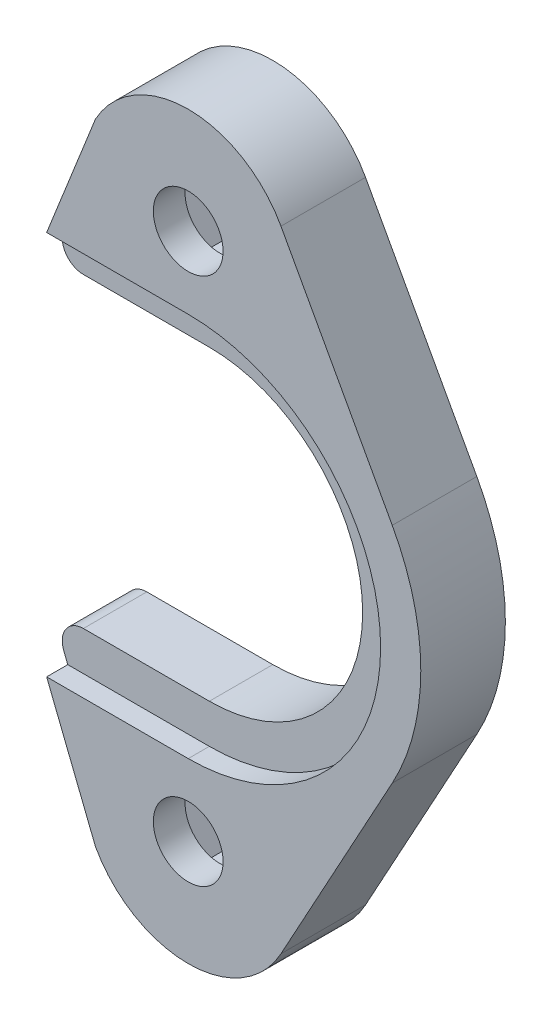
ISO-10303-21;
HEADER;
FILE_DESCRIPTION(('STEP AP214'),'2;1');
FILE_NAME('part.step','',(''),(''),'','','');
FILE_SCHEMA(('AUTOMOTIVE_DESIGN { 1 0 10303 214 1 1 1 1 }'));
ENDSEC;
DATA;
#1=APPLICATION_CONTEXT('core data for automotive mechanical design processes');
#2=APPLICATION_PROTOCOL_DEFINITION('international standard','automotive_design',2000,#1);
#3=PRODUCT_CONTEXT('',#1,'mechanical');
#4=PRODUCT('Part','Part','',(#3));
#5=PRODUCT_RELATED_PRODUCT_CATEGORY('part','',(#4));
#6=PRODUCT_DEFINITION_FORMATION('','',#4);
#7=PRODUCT_DEFINITION_CONTEXT('part definition',#1,'design');
#8=PRODUCT_DEFINITION('design','',#6,#7);
#9=PRODUCT_DEFINITION_SHAPE('','',#8);
#10=(LENGTH_UNIT() NAMED_UNIT(*) SI_UNIT(.MILLI.,.METRE.));
#11=(NAMED_UNIT(*) PLANE_ANGLE_UNIT() SI_UNIT($,.RADIAN.));
#12=(NAMED_UNIT(*) SI_UNIT($,.STERADIAN.) SOLID_ANGLE_UNIT());
#13=UNCERTAINTY_MEASURE_WITH_UNIT(LENGTH_MEASURE(1.E-05),#10,'distance_accuracy_value','');
#14=(GEOMETRIC_REPRESENTATION_CONTEXT(3) GLOBAL_UNCERTAINTY_ASSIGNED_CONTEXT((#13)) GLOBAL_UNIT_ASSIGNED_CONTEXT((#10,
#11,#12)) REPRESENTATION_CONTEXT('',''));
#15=CARTESIAN_POINT('',(0.,0.,0.));
#16=DIRECTION('',(0.,0.,1.));
#17=DIRECTION('',(1.,0.,0.));
#18=AXIS2_PLACEMENT_3D('',#15,#16,#17);
#19=CARTESIAN_POINT('',(0.,-7.25,-4.));
#20=DIRECTION('',(0.,1.,0.));
#21=DIRECTION('',(-1.,0.,0.));
#22=AXIS2_PLACEMENT_3D('',#19,#20,#21);
#23=PLANE('',#22);
#24=DIRECTION('',(-1.,0.,0.));
#25=VECTOR('',#24,1.);
#26=CARTESIAN_POINT('',(0.,-7.25,-4.));
#27=LINE('',#26,#25);
#28=CARTESIAN_POINT('',(0.,-7.25,-4.));
#29=VERTEX_POINT('',#28);
#30=CARTESIAN_POINT('',(-5.95765916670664,-7.25,-4.));
#31=VERTEX_POINT('',#30);
#32=EDGE_CURVE('E392',#29,#31,#27,.T.);
#33=ORIENTED_EDGE('',*,*,#32,.T.);
#34=DIRECTION('',(0.,0.,1.));
#35=VECTOR('',#34,1.);
#36=CARTESIAN_POINT('',(-5.95765916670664,-7.25,-4.));
#37=LINE('',#36,#35);
#38=CARTESIAN_POINT('',(-5.95765916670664,-7.25,-1.));
#39=VERTEX_POINT('',#38);
#40=EDGE_CURVE('E41',#31,#39,#37,.T.);
#41=ORIENTED_EDGE('',*,*,#40,.T.);
#42=DIRECTION('',(1.,0.,0.));
#43=VECTOR('',#42,1.);
#44=CARTESIAN_POINT('',(0.,-7.25,-1.));
#45=LINE('',#44,#43);
#46=CARTESIAN_POINT('',(0.,-7.25,-1.));
#47=VERTEX_POINT('',#46);
#48=EDGE_CURVE('E259',#39,#47,#45,.T.);
#49=ORIENTED_EDGE('',*,*,#48,.T.);
#50=DIRECTION('',(0.,0.,1.));
#51=VECTOR('',#50,1.);
#52=CARTESIAN_POINT('',(0.,-7.25,-4.));
#53=LINE('',#52,#51);
#54=EDGE_CURVE('E419',#29,#47,#53,.T.);
#55=ORIENTED_EDGE('',*,*,#54,.F.);
#56=EDGE_LOOP('',(#33,#41,#49,#55));
#57=FACE_BOUND('',#56,.T.);
#58=ADVANCED_FACE('F33',(#57),#23,.T.);
#59=CARTESIAN_POINT('',(0.,0.,-4.));
#60=DIRECTION('',(0.,0.,1.));
#61=DIRECTION('',(1.,0.,0.));
#62=AXIS2_PLACEMENT_3D('',#59,#60,#61);
#63=CYLINDRICAL_SURFACE('',#62,7.25);
#64=ORIENTED_EDGE('',*,*,#54,.T.);
#65=CARTESIAN_POINT('',(0.,0.,-1.));
#66=DIRECTION('',(0.,0.,1.));
#67=DIRECTION('',(1.,0.,0.));
#68=AXIS2_PLACEMENT_3D('',#65,#66,#67);
#69=CIRCLE('',#68,7.25);
#70=CARTESIAN_POINT('',(0.,7.25,-1.));
#71=VERTEX_POINT('',#70);
#72=EDGE_CURVE('E256',#47,#71,#69,.T.);
#73=ORIENTED_EDGE('',*,*,#72,.T.);
#74=DIRECTION('',(0.,0.,1.));
#75=VECTOR('',#74,1.);
#76=CARTESIAN_POINT('',(0.,7.25,-4.));
#77=LINE('',#76,#75);
#78=CARTESIAN_POINT('',(0.,7.25,-4.));
#79=VERTEX_POINT('',#78);
#80=EDGE_CURVE('E422',#79,#71,#77,.T.);
#81=ORIENTED_EDGE('',*,*,#80,.F.);
#82=CARTESIAN_POINT('',(0.,0.,-4.));
#83=DIRECTION('',(0.,0.,-1.));
#84=DIRECTION('',(1.,0.,0.));
#85=AXIS2_PLACEMENT_3D('',#82,#83,#84);
#86=CIRCLE('',#85,7.25);
#87=EDGE_CURVE('E389',#79,#29,#86,.T.);
#88=ORIENTED_EDGE('',*,*,#87,.T.);
#89=EDGE_LOOP('',(#64,#73,#81,#88));
#90=FACE_BOUND('',#89,.T.);
#91=ADVANCED_FACE('F461',(#90),#63,.F.);
#92=CARTESIAN_POINT('',(0.,7.25,-4.));
#93=DIRECTION('',(0.,-1.,0.));
#94=DIRECTION('',(0.,0.,-1.));
#95=AXIS2_PLACEMENT_3D('',#92,#93,#94);
#96=PLANE('',#95);
#97=DIRECTION('',(-1.,0.,0.));
#98=VECTOR('',#97,1.);
#99=CARTESIAN_POINT('',(0.,7.25,-1.));
#100=LINE('',#99,#98);
#101=CARTESIAN_POINT('',(-5.95765916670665,7.25,-1.));
#102=VERTEX_POINT('',#101);
#103=EDGE_CURVE('E253',#71,#102,#100,.T.);
#104=ORIENTED_EDGE('',*,*,#103,.T.);
#105=DIRECTION('',(0.,0.,1.));
#106=VECTOR('',#105,1.);
#107=CARTESIAN_POINT('',(-5.95765916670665,7.25,-4.));
#108=LINE('',#107,#106);
#109=CARTESIAN_POINT('',(-5.95765916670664,7.25,-4.));
#110=VERTEX_POINT('',#109);
#111=EDGE_CURVE('E449',#102,#110,#108,.F.);
#112=ORIENTED_EDGE('',*,*,#111,.T.);
#113=DIRECTION('',(1.,0.,0.));
#114=VECTOR('',#113,1.);
#115=CARTESIAN_POINT('',(0.,7.25,-4.));
#116=LINE('',#115,#114);
#117=EDGE_CURVE('E387',#110,#79,#116,.T.);
#118=ORIENTED_EDGE('',*,*,#117,.T.);
#119=ORIENTED_EDGE('',*,*,#80,.T.);
#120=EDGE_LOOP('',(#104,#112,#118,#119));
#121=FACE_BOUND('',#120,.T.);
#122=ADVANCED_FACE('F474',(#121),#96,.T.);
#123=CARTESIAN_POINT('',(0.,12.5001927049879,-4.));
#124=DIRECTION('',(0.,0.,1.));
#125=DIRECTION('',(1.,0.,0.));
#126=AXIS2_PLACEMENT_3D('',#123,#124,#125);
#127=CYLINDRICAL_SURFACE('',#126,1.65);
#128=CARTESIAN_POINT('',(0.,12.5001927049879,0.));
#129=DIRECTION('',(0.,0.,1.));
#130=DIRECTION('',(-1.,0.,0.));
#131=AXIS2_PLACEMENT_3D('',#128,#129,#130);
#132=CIRCLE('',#131,1.65);
#133=CARTESIAN_POINT('',(-1.65,12.5001927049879,0.));
#134=VERTEX_POINT('',#133);
#135=EDGE_CURVE('E361',#134,#134,#132,.T.);
#136=ORIENTED_EDGE('',*,*,#135,.T.);
#137=EDGE_LOOP('',(#136));
#138=FACE_BOUND('',#137,.T.);
#139=CARTESIAN_POINT('',(0.,12.5001927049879,-1.5));
#140=DIRECTION('',(0.,0.,-1.));
#141=DIRECTION('',(-1.,0.,0.));
#142=AXIS2_PLACEMENT_3D('',#139,#140,#141);
#143=CIRCLE('',#142,1.65);
#144=CARTESIAN_POINT('',(-1.65,12.5001927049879,-1.5));
#145=VERTEX_POINT('',#144);
#146=EDGE_CURVE('E350',#145,#145,#143,.F.);
#147=ORIENTED_EDGE('',*,*,#146,.F.);
#148=EDGE_LOOP('',(#147));
#149=FACE_BOUND('',#148,.T.);
#150=ADVANCED_FACE('F476',(#138,#149),#127,.F.);
#151=CARTESIAN_POINT('',(0.,-12.5001927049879,-4.));
#152=DIRECTION('',(0.,0.,1.));
#153=DIRECTION('',(1.,0.,0.));
#154=AXIS2_PLACEMENT_3D('',#151,#152,#153);
#155=CYLINDRICAL_SURFACE('',#154,5.);
#156=CARTESIAN_POINT('',(0.,-12.5001927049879,0.));
#157=DIRECTION('',(0.,0.,1.));
#158=DIRECTION('',(-1.,0.,0.));
#159=AXIS2_PLACEMENT_3D('',#156,#157,#158);
#160=CIRCLE('',#159,5.);
#161=CARTESIAN_POINT('',(-4.38636268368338,-14.9001557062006,0.));
#162=VERTEX_POINT('',#161);
#163=CARTESIAN_POINT('',(4.38636268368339,-14.9001557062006,0.));
#164=VERTEX_POINT('',#163);
#165=EDGE_CURVE('E367',#162,#164,#160,.T.);
#166=ORIENTED_EDGE('',*,*,#165,.F.);
#167=DIRECTION('',(0.,0.,1.));
#168=VECTOR('',#167,1.);
#169=CARTESIAN_POINT('',(-4.38636268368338,-14.9001557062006,-4.));
#170=LINE('',#169,#168);
#171=CARTESIAN_POINT('',(-4.38636268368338,-14.9001557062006,-4.));
#172=VERTEX_POINT('',#171);
#173=EDGE_CURVE('E415',#172,#162,#170,.T.);
#174=ORIENTED_EDGE('',*,*,#173,.F.);
#175=CARTESIAN_POINT('',(0.,-12.5001927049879,-4.));
#176=DIRECTION('',(0.,0.,1.));
#177=DIRECTION('',(-1.,0.,0.));
#178=AXIS2_PLACEMENT_3D('',#175,#176,#177);
#179=CIRCLE('',#178,5.);
#180=CARTESIAN_POINT('',(4.38636268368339,-14.9001557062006,-4.));
#181=VERTEX_POINT('',#180);
#182=EDGE_CURVE('E368',#172,#181,#179,.T.);
#183=ORIENTED_EDGE('',*,*,#182,.T.);
#184=DIRECTION('',(0.,0.,1.));
#185=VECTOR('',#184,1.);
#186=CARTESIAN_POINT('',(4.38636268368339,-14.9001557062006,-4.));
#187=LINE('',#186,#185);
#188=EDGE_CURVE('E396',#181,#164,#187,.T.);
#189=ORIENTED_EDGE('',*,*,#188,.T.);
#190=EDGE_LOOP('',(#166,#174,#183,#189));
#191=FACE_BOUND('',#190,.T.);
#192=ADVANCED_FACE('F482',(#191),#155,.T.);
#193=CARTESIAN_POINT('',(-7.43213117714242,-7.25,-4.));
#194=DIRECTION('',(-0.929074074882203,-0.369893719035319,0.));
#195=DIRECTION('',(0.369893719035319,-0.929074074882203,0.));
#196=AXIS2_PLACEMENT_3D('',#193,#194,#195);
#197=PLANE('',#196);
#198=DIRECTION('',(-0.369893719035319,0.929074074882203,0.));
#199=VECTOR('',#198,1.);
#200=CARTESIAN_POINT('',(-7.43213117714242,-7.25,-1.));
#201=LINE('',#200,#199);
#202=CARTESIAN_POINT('',(-6.69558777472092,-9.1,-1.));
#203=VERTEX_POINT('',#202);
#204=CARTESIAN_POINT('',(-6.88673324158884,-8.61989371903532,-1.));
#205=VERTEX_POINT('',#204);
#206=EDGE_CURVE('E261',#203,#205,#201,.T.);
#207=ORIENTED_EDGE('',*,*,#206,.T.);
#208=DIRECTION('',(0.,0.,1.));
#209=VECTOR('',#208,1.);
#210=CARTESIAN_POINT('',(-6.88673324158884,-8.61989371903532,-4.));
#211=LINE('',#210,#209);
#212=CARTESIAN_POINT('',(-6.88673324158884,-8.61989371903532,-4.));
#213=VERTEX_POINT('',#212);
#214=EDGE_CURVE('E11',#205,#213,#211,.F.);
#215=ORIENTED_EDGE('',*,*,#214,.T.);
#216=DIRECTION('',(0.369893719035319,-0.929074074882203,0.));
#217=VECTOR('',#216,1.);
#218=CARTESIAN_POINT('',(-7.43213117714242,-7.25,-4.));
#219=LINE('',#218,#217);
#220=EDGE_CURVE('E394',#213,#172,#219,.T.);
#221=ORIENTED_EDGE('',*,*,#220,.T.);
#222=ORIENTED_EDGE('',*,*,#173,.T.);
#223=DIRECTION('',(0.369893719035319,-0.929074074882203,0.));
#224=VECTOR('',#223,1.);
#225=CARTESIAN_POINT('',(-7.43213117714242,-7.25,0.));
#226=LINE('',#225,#224);
#227=CARTESIAN_POINT('',(-6.69558777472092,-9.1,0.));
#228=VERTEX_POINT('',#227);
#229=EDGE_CURVE('E372',#228,#162,#226,.T.);
#230=ORIENTED_EDGE('',*,*,#229,.F.);
#231=DIRECTION('',(0.,0.,1.));
#232=VECTOR('',#231,1.);
#233=CARTESIAN_POINT('',(-6.69558777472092,-9.1,-4.));
#234=LINE('',#233,#232);
#235=EDGE_CURVE('E251',#203,#228,#234,.T.);
#236=ORIENTED_EDGE('',*,*,#235,.F.);
#237=EDGE_LOOP('',(#207,#215,#221,#222,#230,#236));
#238=FACE_BOUND('',#237,.T.);
#239=ADVANCED_FACE('F492',(#238),#197,.T.);
#240=CARTESIAN_POINT('',(-7.43213117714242,7.25,-4.));
#241=DIRECTION('',(-0.929074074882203,0.369893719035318,0.));
#242=DIRECTION('',(-0.369893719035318,-0.929074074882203,0.));
#243=AXIS2_PLACEMENT_3D('',#240,#241,#242);
#244=PLANE('',#243);
#245=DIRECTION('',(-0.369893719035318,-0.929074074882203,0.));
#246=VECTOR('',#245,1.);
#247=CARTESIAN_POINT('',(-7.43213117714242,7.25,-4.));
#248=LINE('',#247,#246);
#249=CARTESIAN_POINT('',(-4.38636268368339,14.9001557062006,-4.));
#250=VERTEX_POINT('',#249);
#251=CARTESIAN_POINT('',(-6.88673324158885,8.61989371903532,-4.));
#252=VERTEX_POINT('',#251);
#253=EDGE_CURVE('E384',#250,#252,#248,.T.);
#254=ORIENTED_EDGE('',*,*,#253,.T.);
#255=DIRECTION('',(0.,0.,1.));
#256=VECTOR('',#255,1.);
#257=CARTESIAN_POINT('',(-6.88673324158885,8.61989371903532,-4.));
#258=LINE('',#257,#256);
#259=CARTESIAN_POINT('',(-6.88673324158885,8.61989371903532,-1.));
#260=VERTEX_POINT('',#259);
#261=EDGE_CURVE('E442',#252,#260,#258,.T.);
#262=ORIENTED_EDGE('',*,*,#261,.T.);
#263=DIRECTION('',(0.369893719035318,0.929074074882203,0.));
#264=VECTOR('',#263,1.);
#265=CARTESIAN_POINT('',(-7.43213117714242,7.25,-1.));
#266=LINE('',#265,#264);
#267=CARTESIAN_POINT('',(-6.69558777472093,9.1,-1.));
#268=VERTEX_POINT('',#267);
#269=EDGE_CURVE('E440',#260,#268,#266,.T.);
#270=ORIENTED_EDGE('',*,*,#269,.T.);
#271=DIRECTION('',(0.,0.,-1.));
#272=VECTOR('',#271,1.);
#273=CARTESIAN_POINT('',(-6.69558777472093,9.1,-4.));
#274=LINE('',#273,#272);
#275=CARTESIAN_POINT('',(-6.69558777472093,9.1,0.));
#276=VERTEX_POINT('',#275);
#277=EDGE_CURVE('E236',#276,#268,#274,.T.);
#278=ORIENTED_EDGE('',*,*,#277,.F.);
#279=DIRECTION('',(-0.369893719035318,-0.929074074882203,0.));
#280=VECTOR('',#279,1.);
#281=CARTESIAN_POINT('',(-7.43213117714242,7.25,0.));
#282=LINE('',#281,#280);
#283=CARTESIAN_POINT('',(-4.38636268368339,14.9001557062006,0.));
#284=VERTEX_POINT('',#283);
#285=EDGE_CURVE('E411',#284,#276,#282,.T.);
#286=ORIENTED_EDGE('',*,*,#285,.F.);
#287=DIRECTION('',(0.,0.,1.));
#288=VECTOR('',#287,1.);
#289=CARTESIAN_POINT('',(-4.38636268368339,14.9001557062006,-4.));
#290=LINE('',#289,#288);
#291=EDGE_CURVE('E425',#250,#284,#290,.T.);
#292=ORIENTED_EDGE('',*,*,#291,.F.);
#293=EDGE_LOOP('',(#254,#262,#270,#278,#286,#292));
#294=FACE_BOUND('',#293,.T.);
#295=ADVANCED_FACE('F473',(#294),#244,.T.);
#296=CARTESIAN_POINT('',(0.,12.5001927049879,-4.));
#297=DIRECTION('',(0.,0.,1.));
#298=DIRECTION('',(1.,0.,0.));
#299=AXIS2_PLACEMENT_3D('',#296,#297,#298);
#300=CYLINDRICAL_SURFACE('',#299,5.);
#301=CARTESIAN_POINT('',(0.,12.5001927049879,0.));
#302=DIRECTION('',(0.,0.,1.));
#303=DIRECTION('',(1.,0.,0.));
#304=AXIS2_PLACEMENT_3D('',#301,#302,#303);
#305=CIRCLE('',#304,5.);
#306=CARTESIAN_POINT('',(4.38636268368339,14.9001557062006,0.));
#307=VERTEX_POINT('',#306);
#308=EDGE_CURVE('E408',#307,#284,#305,.T.);
#309=ORIENTED_EDGE('',*,*,#308,.F.);
#310=DIRECTION('',(0.,0.,1.));
#311=VECTOR('',#310,1.);
#312=CARTESIAN_POINT('',(4.38636268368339,14.9001557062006,-4.));
#313=LINE('',#312,#311);
#314=CARTESIAN_POINT('',(4.38636268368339,14.9001557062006,-4.));
#315=VERTEX_POINT('',#314);
#316=EDGE_CURVE('E427',#315,#307,#313,.T.);
#317=ORIENTED_EDGE('',*,*,#316,.F.);
#318=CARTESIAN_POINT('',(0.,12.5001927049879,-4.));
#319=DIRECTION('',(0.,0.,1.));
#320=DIRECTION('',(1.,0.,0.));
#321=AXIS2_PLACEMENT_3D('',#318,#319,#320);
#322=CIRCLE('',#321,5.);
#323=EDGE_CURVE('E381',#315,#250,#322,.T.);
#324=ORIENTED_EDGE('',*,*,#323,.T.);
#325=ORIENTED_EDGE('',*,*,#291,.T.);
#326=EDGE_LOOP('',(#309,#317,#324,#325));
#327=FACE_BOUND('',#326,.T.);
#328=ADVANCED_FACE('F592',(#327),#300,.T.);
#329=CARTESIAN_POINT('',(9.64999790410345,5.27991860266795,-4.));
#330=DIRECTION('',(0.877272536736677,0.479992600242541,0.));
#331=DIRECTION('',(-0.479992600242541,0.877272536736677,0.));
#332=AXIS2_PLACEMENT_3D('',#329,#330,#331);
#333=PLANE('',#332);
#334=DIRECTION('',(-0.479992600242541,0.877272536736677,0.));
#335=VECTOR('',#334,1.);
#336=CARTESIAN_POINT('',(9.64999790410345,5.27991860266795,0.));
#337=LINE('',#336,#335);
#338=CARTESIAN_POINT('',(9.64999790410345,5.27991860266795,0.));
#339=VERTEX_POINT('',#338);
#340=EDGE_CURVE('E405',#339,#307,#337,.T.);
#341=ORIENTED_EDGE('',*,*,#340,.F.);
#342=DIRECTION('',(0.,0.,1.));
#343=VECTOR('',#342,1.);
#344=CARTESIAN_POINT('',(9.64999790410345,5.27991860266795,-4.));
#345=LINE('',#344,#343);
#346=CARTESIAN_POINT('',(9.64999790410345,5.27991860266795,-4.));
#347=VERTEX_POINT('',#346);
#348=EDGE_CURVE('E429',#347,#339,#345,.T.);
#349=ORIENTED_EDGE('',*,*,#348,.F.);
#350=DIRECTION('',(-0.479992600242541,0.877272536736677,0.));
#351=VECTOR('',#350,1.);
#352=CARTESIAN_POINT('',(9.64999790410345,5.27991860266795,-4.));
#353=LINE('',#352,#351);
#354=EDGE_CURVE('E378',#347,#315,#353,.T.);
#355=ORIENTED_EDGE('',*,*,#354,.T.);
#356=ORIENTED_EDGE('',*,*,#316,.T.);
#357=EDGE_LOOP('',(#341,#349,#355,#356));
#358=FACE_BOUND('',#357,.T.);
#359=ADVANCED_FACE('F588',(#358),#333,.T.);
#360=CARTESIAN_POINT('',(0.,0.,-4.));
#361=DIRECTION('',(0.,0.,1.));
#362=DIRECTION('',(1.,0.,0.));
#363=AXIS2_PLACEMENT_3D('',#360,#361,#362);
#364=CYLINDRICAL_SURFACE('',#363,11.);
#365=CARTESIAN_POINT('',(0.,0.,0.));
#366=DIRECTION('',(0.,0.,1.));
#367=DIRECTION('',(1.,0.,0.));
#368=AXIS2_PLACEMENT_3D('',#365,#366,#367);
#369=CIRCLE('',#368,11.);
#370=CARTESIAN_POINT('',(9.64999790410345,-5.27991860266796,0.));
#371=VERTEX_POINT('',#370);
#372=EDGE_CURVE('E402',#371,#339,#369,.T.);
#373=ORIENTED_EDGE('',*,*,#372,.F.);
#374=DIRECTION('',(0.,0.,1.));
#375=VECTOR('',#374,1.);
#376=CARTESIAN_POINT('',(9.64999790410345,-5.27991860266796,-4.));
#377=LINE('',#376,#375);
#378=CARTESIAN_POINT('',(9.64999790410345,-5.27991860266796,-4.));
#379=VERTEX_POINT('',#378);
#380=EDGE_CURVE('E431',#379,#371,#377,.T.);
#381=ORIENTED_EDGE('',*,*,#380,.F.);
#382=CARTESIAN_POINT('',(0.,0.,-4.));
#383=DIRECTION('',(0.,0.,1.));
#384=DIRECTION('',(1.,0.,0.));
#385=AXIS2_PLACEMENT_3D('',#382,#383,#384);
#386=CIRCLE('',#385,11.);
#387=EDGE_CURVE('E375',#379,#347,#386,.T.);
#388=ORIENTED_EDGE('',*,*,#387,.T.);
#389=ORIENTED_EDGE('',*,*,#348,.T.);
#390=EDGE_LOOP('',(#373,#381,#388,#389));
#391=FACE_BOUND('',#390,.T.);
#392=ADVANCED_FACE('F584',(#391),#364,.T.);
#393=CARTESIAN_POINT('',(9.64999790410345,-5.27991860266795,-4.));
#394=DIRECTION('',(0.877272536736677,-0.479992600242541,0.));
#395=DIRECTION('',(0.479992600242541,0.877272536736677,0.));
#396=AXIS2_PLACEMENT_3D('',#393,#394,#395);
#397=PLANE('',#396);
#398=DIRECTION('',(0.479992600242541,0.877272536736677,0.));
#399=VECTOR('',#398,1.);
#400=CARTESIAN_POINT('',(9.64999790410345,-5.27991860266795,0.));
#401=LINE('',#400,#399);
#402=EDGE_CURVE('E399',#164,#371,#401,.T.);
#403=ORIENTED_EDGE('',*,*,#402,.F.);
#404=ORIENTED_EDGE('',*,*,#188,.F.);
#405=DIRECTION('',(0.479992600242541,0.877272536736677,0.));
#406=VECTOR('',#405,1.);
#407=CARTESIAN_POINT('',(9.64999790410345,-5.27991860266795,-4.));
#408=LINE('',#407,#406);
#409=EDGE_CURVE('E371',#181,#379,#408,.T.);
#410=ORIENTED_EDGE('',*,*,#409,.T.);
#411=ORIENTED_EDGE('',*,*,#380,.T.);
#412=EDGE_LOOP('',(#403,#404,#410,#411));
#413=FACE_BOUND('',#412,.T.);
#414=ADVANCED_FACE('F502',(#413),#397,.T.);
#415=CARTESIAN_POINT('',(0.,-12.5001927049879,-4.));
#416=DIRECTION('',(0.,0.,-1.));
#417=DIRECTION('',(-1.,0.,0.));
#418=AXIS2_PLACEMENT_3D('',#415,#416,#417);
#419=PLANE('',#418);
#420=DIRECTION('',(1.,0.,0.));
#421=VECTOR('',#420,1.);
#422=CARTESIAN_POINT('',(1.64544826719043,-9.65019270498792,-4.));
#423=LINE('',#422,#421);
#424=CARTESIAN_POINT('',(-1.64544826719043,-9.65019270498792,-4.));
#425=VERTEX_POINT('',#424);
#426=CARTESIAN_POINT('',(1.64544826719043,-9.65019270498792,-4.));
#427=VERTEX_POINT('',#426);
#428=EDGE_CURVE('E263',#425,#427,#423,.T.);
#429=ORIENTED_EDGE('',*,*,#428,.F.);
#430=DIRECTION('',(0.5,0.866025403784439,0.));
#431=VECTOR('',#430,1.);
#432=CARTESIAN_POINT('',(-1.64544826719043,-9.65019270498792,-4.));
#433=LINE('',#432,#431);
#434=CARTESIAN_POINT('',(-3.29089653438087,-12.5001927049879,-4.));
#435=VERTEX_POINT('',#434);
#436=EDGE_CURVE('E268',#435,#425,#433,.T.);
#437=ORIENTED_EDGE('',*,*,#436,.F.);
#438=DIRECTION('',(-0.5,0.866025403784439,0.));
#439=VECTOR('',#438,1.);
#440=CARTESIAN_POINT('',(-3.29089653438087,-12.5001927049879,-4.));
#441=LINE('',#440,#439);
#442=CARTESIAN_POINT('',(-1.64544826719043,-15.3501927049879,-4.));
#443=VERTEX_POINT('',#442);
#444=EDGE_CURVE('E294',#443,#435,#441,.T.);
#445=ORIENTED_EDGE('',*,*,#444,.F.);
#446=DIRECTION('',(-1.,0.,0.));
#447=VECTOR('',#446,1.);
#448=CARTESIAN_POINT('',(-1.64544826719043,-15.3501927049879,-4.));
#449=LINE('',#448,#447);
#450=CARTESIAN_POINT('',(1.64544826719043,-15.3501927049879,-4.));
#451=VERTEX_POINT('',#450);
#452=EDGE_CURVE('E291',#451,#443,#449,.T.);
#453=ORIENTED_EDGE('',*,*,#452,.F.);
#454=DIRECTION('',(-0.5,-0.866025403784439,0.));
#455=VECTOR('',#454,1.);
#456=CARTESIAN_POINT('',(1.64544826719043,-15.3501927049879,-4.));
#457=LINE('',#456,#455);
#458=CARTESIAN_POINT('',(3.29089653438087,-12.5001927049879,-4.));
#459=VERTEX_POINT('',#458);
#460=EDGE_CURVE('E288',#459,#451,#457,.T.);
#461=ORIENTED_EDGE('',*,*,#460,.F.);
#462=DIRECTION('',(0.5,-0.866025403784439,0.));
#463=VECTOR('',#462,1.);
#464=CARTESIAN_POINT('',(3.29089653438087,-12.5001927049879,-4.));
#465=LINE('',#464,#463);
#466=EDGE_CURVE('E285',#427,#459,#465,.T.);
#467=ORIENTED_EDGE('',*,*,#466,.F.);
#468=EDGE_LOOP('',(#429,#437,#445,#453,#461,#467));
#469=FACE_BOUND('',#468,.T.);
#470=DIRECTION('',(-0.5,0.866025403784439,0.));
#471=VECTOR('',#470,1.);
#472=CARTESIAN_POINT('',(-1.64544826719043,9.65019270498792,-4.));
#473=LINE('',#472,#471);
#474=CARTESIAN_POINT('',(-1.64544826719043,9.65019270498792,-4.));
#475=VERTEX_POINT('',#474);
#476=CARTESIAN_POINT('',(-3.29089653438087,12.5001927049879,-4.));
#477=VERTEX_POINT('',#476);
#478=EDGE_CURVE('E332',#475,#477,#473,.T.);
#479=ORIENTED_EDGE('',*,*,#478,.F.);
#480=DIRECTION('',(-1.,0.,0.));
#481=VECTOR('',#480,1.);
#482=CARTESIAN_POINT('',(1.64544826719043,9.65019270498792,-4.));
#483=LINE('',#482,#481);
#484=CARTESIAN_POINT('',(1.64544826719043,9.65019270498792,-4.));
#485=VERTEX_POINT('',#484);
#486=EDGE_CURVE('E316',#485,#475,#483,.T.);
#487=ORIENTED_EDGE('',*,*,#486,.F.);
#488=DIRECTION('',(-0.5,-0.866025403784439,0.));
#489=VECTOR('',#488,1.);
#490=CARTESIAN_POINT('',(3.29089653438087,12.5001927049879,-4.));
#491=LINE('',#490,#489);
#492=CARTESIAN_POINT('',(3.29089653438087,12.5001927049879,-4.));
#493=VERTEX_POINT('',#492);
#494=EDGE_CURVE('E343',#493,#485,#491,.T.);
#495=ORIENTED_EDGE('',*,*,#494,.F.);
#496=DIRECTION('',(0.5,-0.866025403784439,0.));
#497=VECTOR('',#496,1.);
#498=CARTESIAN_POINT('',(1.64544826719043,15.3501927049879,-4.));
#499=LINE('',#498,#497);
#500=CARTESIAN_POINT('',(1.64544826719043,15.3501927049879,-4.));
#501=VERTEX_POINT('',#500);
#502=EDGE_CURVE('E340',#501,#493,#499,.T.);
#503=ORIENTED_EDGE('',*,*,#502,.F.);
#504=DIRECTION('',(1.,0.,0.));
#505=VECTOR('',#504,1.);
#506=CARTESIAN_POINT('',(-1.64544826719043,15.3501927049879,-4.));
#507=LINE('',#506,#505);
#508=CARTESIAN_POINT('',(-1.64544826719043,15.3501927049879,-4.));
#509=VERTEX_POINT('',#508);
#510=EDGE_CURVE('E337',#509,#501,#507,.T.);
#511=ORIENTED_EDGE('',*,*,#510,.F.);
#512=DIRECTION('',(0.5,0.866025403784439,0.));
#513=VECTOR('',#512,1.);
#514=CARTESIAN_POINT('',(-3.29089653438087,12.5001927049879,-4.));
#515=LINE('',#514,#513);
#516=EDGE_CURVE('E334',#477,#509,#515,.T.);
#517=ORIENTED_EDGE('',*,*,#516,.F.);
#518=EDGE_LOOP('',(#479,#487,#495,#503,#511,#517));
#519=FACE_BOUND('',#518,.T.);
#520=ORIENTED_EDGE('',*,*,#117,.F.);
#521=CARTESIAN_POINT('',(-5.95765916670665,8.25,-4.));
#522=DIRECTION('',(0.,0.,-1.));
#523=DIRECTION('',(-1.,0.,0.));
#524=AXIS2_PLACEMENT_3D('',#521,#522,#523);
#525=CIRCLE('',#524,1.);
#526=EDGE_CURVE('E452',#110,#252,#525,.T.);
#527=ORIENTED_EDGE('',*,*,#526,.T.);
#528=ORIENTED_EDGE('',*,*,#253,.F.);
#529=ORIENTED_EDGE('',*,*,#323,.F.);
#530=ORIENTED_EDGE('',*,*,#354,.F.);
#531=ORIENTED_EDGE('',*,*,#387,.F.);
#532=ORIENTED_EDGE('',*,*,#409,.F.);
#533=ORIENTED_EDGE('',*,*,#182,.F.);
#534=ORIENTED_EDGE('',*,*,#220,.F.);
#535=CARTESIAN_POINT('',(-5.95765916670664,-8.25,-4.));
#536=DIRECTION('',(0.,0.,-1.));
#537=DIRECTION('',(-1.,0.,0.));
#538=AXIS2_PLACEMENT_3D('',#535,#536,#537);
#539=CIRCLE('',#538,1.);
#540=EDGE_CURVE('E48',#213,#31,#539,.T.);
#541=ORIENTED_EDGE('',*,*,#540,.T.);
#542=ORIENTED_EDGE('',*,*,#32,.F.);
#543=ORIENTED_EDGE('',*,*,#87,.F.);
#544=EDGE_LOOP('',(#520,#527,#528,#529,#530,#531,#532,#533,#534,#541,#542,#543));
#545=FACE_BOUND('',#544,.T.);
#546=ADVANCED_FACE('F464',(#469,#519,#545),#419,.T.);
#547=CARTESIAN_POINT('',(0.,-12.5001927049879,0.));
#548=DIRECTION('',(0.,0.,-1.));
#549=DIRECTION('',(-1.,0.,0.));
#550=AXIS2_PLACEMENT_3D('',#547,#548,#549);
#551=PLANE('',#550);
#552=ORIENTED_EDGE('',*,*,#135,.F.);
#553=EDGE_LOOP('',(#552));
#554=FACE_BOUND('',#553,.T.);
#555=CARTESIAN_POINT('',(0.,-12.5001927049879,0.));
#556=DIRECTION('',(0.,0.,1.));
#557=DIRECTION('',(1.,0.,0.));
#558=AXIS2_PLACEMENT_3D('',#555,#556,#557);
#559=CIRCLE('',#558,1.65);
#560=CARTESIAN_POINT('',(1.65,-12.5001927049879,0.));
#561=VERTEX_POINT('',#560);
#562=EDGE_CURVE('E364',#561,#561,#559,.T.);
#563=ORIENTED_EDGE('',*,*,#562,.F.);
#564=EDGE_LOOP('',(#563));
#565=FACE_BOUND('',#564,.T.);
#566=CARTESIAN_POINT('',(0.,0.,0.));
#567=DIRECTION('',(0.,0.,1.));
#568=DIRECTION('',(1.,0.,0.));
#569=AXIS2_PLACEMENT_3D('',#566,#567,#568);
#570=CIRCLE('',#569,9.1);
#571=CARTESIAN_POINT('',(0.,-9.1,0.));
#572=VERTEX_POINT('',#571);
#573=CARTESIAN_POINT('',(0.,9.1,0.));
#574=VERTEX_POINT('',#573);
#575=EDGE_CURVE('E225',#572,#574,#570,.T.);
#576=ORIENTED_EDGE('',*,*,#575,.F.);
#577=DIRECTION('',(-1.,0.,0.));
#578=VECTOR('',#577,1.);
#579=CARTESIAN_POINT('',(0.,-9.1,0.));
#580=LINE('',#579,#578);
#581=EDGE_CURVE('E418',#572,#228,#580,.T.);
#582=ORIENTED_EDGE('',*,*,#581,.T.);
#583=ORIENTED_EDGE('',*,*,#229,.T.);
#584=ORIENTED_EDGE('',*,*,#165,.T.);
#585=ORIENTED_EDGE('',*,*,#402,.T.);
#586=ORIENTED_EDGE('',*,*,#372,.T.);
#587=ORIENTED_EDGE('',*,*,#340,.T.);
#588=ORIENTED_EDGE('',*,*,#308,.T.);
#589=ORIENTED_EDGE('',*,*,#285,.T.);
#590=DIRECTION('',(-1.,0.,0.));
#591=VECTOR('',#590,1.);
#592=CARTESIAN_POINT('',(0.,9.1,0.));
#593=LINE('',#592,#591);
#594=EDGE_CURVE('E243',#574,#276,#593,.T.);
#595=ORIENTED_EDGE('',*,*,#594,.F.);
#596=EDGE_LOOP('',(#576,#582,#583,#584,#585,#586,#587,#588,#589,#595));
#597=FACE_BOUND('',#596,.T.);
#598=ADVANCED_FACE('F495',(#554,#565,#597),#551,.F.);
#599=CARTESIAN_POINT('',(0.,-12.5001927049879,-4.));
#600=DIRECTION('',(0.,0.,1.));
#601=DIRECTION('',(1.,0.,0.));
#602=AXIS2_PLACEMENT_3D('',#599,#600,#601);
#603=CYLINDRICAL_SURFACE('',#602,1.65);
#604=CARTESIAN_POINT('',(0.,-12.5001927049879,-1.5));
#605=DIRECTION('',(0.,0.,1.));
#606=DIRECTION('',(1.,0.,0.));
#607=AXIS2_PLACEMENT_3D('',#604,#605,#606);
#608=CIRCLE('',#607,1.65);
#609=CARTESIAN_POINT('',(1.65,-12.5001927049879,-1.5));
#610=VERTEX_POINT('',#609);
#611=EDGE_CURVE('E301',#610,#610,#608,.F.);
#612=ORIENTED_EDGE('',*,*,#611,.T.);
#613=EDGE_LOOP('',(#612));
#614=FACE_BOUND('',#613,.T.);
#615=ORIENTED_EDGE('',*,*,#562,.T.);
#616=EDGE_LOOP('',(#615));
#617=FACE_BOUND('',#616,.T.);
#618=ADVANCED_FACE('F498',(#614,#617),#603,.F.);
#619=CARTESIAN_POINT('',(0.,0.,-1.5));
#620=DIRECTION('',(0.,0.,-1.));
#621=DIRECTION('',(-1.,0.,0.));
#622=AXIS2_PLACEMENT_3D('',#619,#620,#621);
#623=PLANE('',#622);
#624=DIRECTION('',(-0.5,0.866025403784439,0.));
#625=VECTOR('',#624,1.);
#626=CARTESIAN_POINT('',(-1.64544826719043,9.65019270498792,-1.5));
#627=LINE('',#626,#625);
#628=CARTESIAN_POINT('',(-1.64544826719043,9.65019270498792,-1.5));
#629=VERTEX_POINT('',#628);
#630=CARTESIAN_POINT('',(-3.29089653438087,12.5001927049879,-1.5));
#631=VERTEX_POINT('',#630);
#632=EDGE_CURVE('E312',#629,#631,#627,.T.);
#633=ORIENTED_EDGE('',*,*,#632,.T.);
#634=DIRECTION('',(0.5,0.866025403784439,0.));
#635=VECTOR('',#634,1.);
#636=CARTESIAN_POINT('',(-3.29089653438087,12.5001927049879,-1.5));
#637=LINE('',#636,#635);
#638=CARTESIAN_POINT('',(-1.64544826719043,15.3501927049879,-1.5));
#639=VERTEX_POINT('',#638);
#640=EDGE_CURVE('E315',#631,#639,#637,.T.);
#641=ORIENTED_EDGE('',*,*,#640,.T.);
#642=DIRECTION('',(1.,0.,0.));
#643=VECTOR('',#642,1.);
#644=CARTESIAN_POINT('',(-1.64544826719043,15.3501927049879,-1.5));
#645=LINE('',#644,#643);
#646=CARTESIAN_POINT('',(1.64544826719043,15.3501927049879,-1.5));
#647=VERTEX_POINT('',#646);
#648=EDGE_CURVE('E319',#639,#647,#645,.T.);
#649=ORIENTED_EDGE('',*,*,#648,.T.);
#650=DIRECTION('',(0.5,-0.866025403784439,0.));
#651=VECTOR('',#650,1.);
#652=CARTESIAN_POINT('',(1.64544826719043,15.3501927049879,-1.5));
#653=LINE('',#652,#651);
#654=CARTESIAN_POINT('',(3.29089653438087,12.5001927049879,-1.5));
#655=VERTEX_POINT('',#654);
#656=EDGE_CURVE('E322',#647,#655,#653,.T.);
#657=ORIENTED_EDGE('',*,*,#656,.T.);
#658=DIRECTION('',(-0.5,-0.866025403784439,0.));
#659=VECTOR('',#658,1.);
#660=CARTESIAN_POINT('',(3.29089653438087,12.5001927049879,-1.5));
#661=LINE('',#660,#659);
#662=CARTESIAN_POINT('',(1.64544826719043,9.65019270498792,-1.5));
#663=VERTEX_POINT('',#662);
#664=EDGE_CURVE('E325',#655,#663,#661,.T.);
#665=ORIENTED_EDGE('',*,*,#664,.T.);
#666=DIRECTION('',(-1.,0.,0.));
#667=VECTOR('',#666,1.);
#668=CARTESIAN_POINT('',(1.64544826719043,9.65019270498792,-1.5));
#669=LINE('',#668,#667);
#670=EDGE_CURVE('E328',#663,#629,#669,.T.);
#671=ORIENTED_EDGE('',*,*,#670,.T.);
#672=EDGE_LOOP('',(#633,#641,#649,#657,#665,#671));
#673=FACE_BOUND('',#672,.T.);
#674=ORIENTED_EDGE('',*,*,#146,.T.);
#675=EDGE_LOOP('',(#674));
#676=FACE_BOUND('',#675,.T.);
#677=ADVANCED_FACE('F505',(#673,#676),#623,.T.);
#678=CARTESIAN_POINT('',(-1.64544826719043,9.65019270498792,-1.5));
#679=DIRECTION('',(-0.866025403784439,-0.5,0.));
#680=DIRECTION('',(0.5,-0.866025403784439,0.));
#681=AXIS2_PLACEMENT_3D('',#678,#679,#680);
#682=PLANE('',#681);
#683=ORIENTED_EDGE('',*,*,#478,.T.);
#684=DIRECTION('',(0.,0.,-1.));
#685=VECTOR('',#684,1.);
#686=CARTESIAN_POINT('',(-3.29089653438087,12.5001927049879,-1.5));
#687=LINE('',#686,#685);
#688=EDGE_CURVE('E331',#631,#477,#687,.T.);
#689=ORIENTED_EDGE('',*,*,#688,.F.);
#690=ORIENTED_EDGE('',*,*,#632,.F.);
#691=DIRECTION('',(0.,0.,-1.));
#692=VECTOR('',#691,1.);
#693=CARTESIAN_POINT('',(-1.64544826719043,9.65019270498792,-1.5));
#694=LINE('',#693,#692);
#695=EDGE_CURVE('E348',#629,#475,#694,.T.);
#696=ORIENTED_EDGE('',*,*,#695,.T.);
#697=EDGE_LOOP('',(#683,#689,#690,#696));
#698=FACE_BOUND('',#697,.T.);
#699=ADVANCED_FACE('F508',(#698),#682,.F.);
#700=CARTESIAN_POINT('',(1.64544826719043,9.65019270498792,-1.5));
#701=DIRECTION('',(0.,-1.,0.));
#702=DIRECTION('',(0.,0.,-1.));
#703=AXIS2_PLACEMENT_3D('',#700,#701,#702);
#704=PLANE('',#703);
#705=ORIENTED_EDGE('',*,*,#486,.T.);
#706=ORIENTED_EDGE('',*,*,#695,.F.);
#707=ORIENTED_EDGE('',*,*,#670,.F.);
#708=DIRECTION('',(0.,0.,-1.));
#709=VECTOR('',#708,1.);
#710=CARTESIAN_POINT('',(1.64544826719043,9.65019270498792,-1.5));
#711=LINE('',#710,#709);
#712=EDGE_CURVE('E351',#663,#485,#711,.T.);
#713=ORIENTED_EDGE('',*,*,#712,.T.);
#714=EDGE_LOOP('',(#705,#706,#707,#713));
#715=FACE_BOUND('',#714,.T.);
#716=ADVANCED_FACE('F511',(#715),#704,.F.);
#717=CARTESIAN_POINT('',(3.29089653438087,12.5001927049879,-1.5));
#718=DIRECTION('',(0.866025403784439,-0.5,0.));
#719=DIRECTION('',(0.5,0.866025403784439,0.));
#720=AXIS2_PLACEMENT_3D('',#717,#718,#719);
#721=PLANE('',#720);
#722=ORIENTED_EDGE('',*,*,#494,.T.);
#723=ORIENTED_EDGE('',*,*,#712,.F.);
#724=ORIENTED_EDGE('',*,*,#664,.F.);
#725=DIRECTION('',(0.,0.,-1.));
#726=VECTOR('',#725,1.);
#727=CARTESIAN_POINT('',(3.29089653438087,12.5001927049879,-1.5));
#728=LINE('',#727,#726);
#729=EDGE_CURVE('E353',#655,#493,#728,.T.);
#730=ORIENTED_EDGE('',*,*,#729,.T.);
#731=EDGE_LOOP('',(#722,#723,#724,#730));
#732=FACE_BOUND('',#731,.T.);
#733=ADVANCED_FACE('F525',(#732),#721,.F.);
#734=CARTESIAN_POINT('',(1.64544826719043,15.3501927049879,-1.5));
#735=DIRECTION('',(0.866025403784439,0.5,0.));
#736=DIRECTION('',(-0.5,0.866025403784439,0.));
#737=AXIS2_PLACEMENT_3D('',#734,#735,#736);
#738=PLANE('',#737);
#739=ORIENTED_EDGE('',*,*,#502,.T.);
#740=ORIENTED_EDGE('',*,*,#729,.F.);
#741=ORIENTED_EDGE('',*,*,#656,.F.);
#742=DIRECTION('',(0.,0.,-1.));
#743=VECTOR('',#742,1.);
#744=CARTESIAN_POINT('',(1.64544826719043,15.3501927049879,-1.5));
#745=LINE('',#744,#743);
#746=EDGE_CURVE('E355',#647,#501,#745,.T.);
#747=ORIENTED_EDGE('',*,*,#746,.T.);
#748=EDGE_LOOP('',(#739,#740,#741,#747));
#749=FACE_BOUND('',#748,.T.);
#750=ADVANCED_FACE('F521',(#749),#738,.F.);
#751=CARTESIAN_POINT('',(-1.64544826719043,15.3501927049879,-1.5));
#752=DIRECTION('',(0.,1.,0.));
#753=DIRECTION('',(0.,0.,1.));
#754=AXIS2_PLACEMENT_3D('',#751,#752,#753);
#755=PLANE('',#754);
#756=ORIENTED_EDGE('',*,*,#510,.T.);
#757=ORIENTED_EDGE('',*,*,#746,.F.);
#758=ORIENTED_EDGE('',*,*,#648,.F.);
#759=DIRECTION('',(0.,0.,-1.));
#760=VECTOR('',#759,1.);
#761=CARTESIAN_POINT('',(-1.64544826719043,15.3501927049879,-1.5));
#762=LINE('',#761,#760);
#763=EDGE_CURVE('E357',#639,#509,#762,.T.);
#764=ORIENTED_EDGE('',*,*,#763,.T.);
#765=EDGE_LOOP('',(#756,#757,#758,#764));
#766=FACE_BOUND('',#765,.T.);
#767=ADVANCED_FACE('F517',(#766),#755,.F.);
#768=CARTESIAN_POINT('',(-3.29089653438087,12.5001927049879,-1.5));
#769=DIRECTION('',(-0.866025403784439,0.5,0.));
#770=DIRECTION('',(-0.5,-0.866025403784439,0.));
#771=AXIS2_PLACEMENT_3D('',#768,#769,#770);
#772=PLANE('',#771);
#773=ORIENTED_EDGE('',*,*,#516,.T.);
#774=ORIENTED_EDGE('',*,*,#763,.F.);
#775=ORIENTED_EDGE('',*,*,#640,.F.);
#776=ORIENTED_EDGE('',*,*,#688,.T.);
#777=EDGE_LOOP('',(#773,#774,#775,#776));
#778=FACE_BOUND('',#777,.T.);
#779=ADVANCED_FACE('F513',(#778),#772,.F.);
#780=CARTESIAN_POINT('',(0.,0.,-1.5));
#781=DIRECTION('',(0.,0.,1.));
#782=DIRECTION('',(1.,0.,0.));
#783=AXIS2_PLACEMENT_3D('',#780,#781,#782);
#784=PLANE('',#783);
#785=DIRECTION('',(1.,0.,0.));
#786=VECTOR('',#785,1.);
#787=CARTESIAN_POINT('',(1.64544826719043,-9.65019270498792,-1.5));
#788=LINE('',#787,#786);
#789=CARTESIAN_POINT('',(-1.64544826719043,-9.65019270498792,-1.5));
#790=VERTEX_POINT('',#789);
#791=CARTESIAN_POINT('',(1.64544826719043,-9.65019270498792,-1.5));
#792=VERTEX_POINT('',#791);
#793=EDGE_CURVE('E264',#790,#792,#788,.T.);
#794=ORIENTED_EDGE('',*,*,#793,.T.);
#795=DIRECTION('',(0.5,-0.866025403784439,0.));
#796=VECTOR('',#795,1.);
#797=CARTESIAN_POINT('',(3.29089653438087,-12.5001927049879,-1.5));
#798=LINE('',#797,#796);
#799=CARTESIAN_POINT('',(3.29089653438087,-12.5001927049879,-1.5));
#800=VERTEX_POINT('',#799);
#801=EDGE_CURVE('E267',#792,#800,#798,.T.);
#802=ORIENTED_EDGE('',*,*,#801,.T.);
#803=DIRECTION('',(-0.5,-0.866025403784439,0.));
#804=VECTOR('',#803,1.);
#805=CARTESIAN_POINT('',(1.64544826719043,-15.3501927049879,-1.5));
#806=LINE('',#805,#804);
#807=CARTESIAN_POINT('',(1.64544826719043,-15.3501927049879,-1.5));
#808=VERTEX_POINT('',#807);
#809=EDGE_CURVE('E271',#800,#808,#806,.T.);
#810=ORIENTED_EDGE('',*,*,#809,.T.);
#811=DIRECTION('',(-1.,0.,0.));
#812=VECTOR('',#811,1.);
#813=CARTESIAN_POINT('',(-1.64544826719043,-15.3501927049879,-1.5));
#814=LINE('',#813,#812);
#815=CARTESIAN_POINT('',(-1.64544826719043,-15.3501927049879,-1.5));
#816=VERTEX_POINT('',#815);
#817=EDGE_CURVE('E274',#808,#816,#814,.T.);
#818=ORIENTED_EDGE('',*,*,#817,.T.);
#819=DIRECTION('',(-0.5,0.866025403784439,0.));
#820=VECTOR('',#819,1.);
#821=CARTESIAN_POINT('',(-3.29089653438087,-12.5001927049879,-1.5));
#822=LINE('',#821,#820);
#823=CARTESIAN_POINT('',(-3.29089653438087,-12.5001927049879,-1.5));
#824=VERTEX_POINT('',#823);
#825=EDGE_CURVE('E277',#816,#824,#822,.T.);
#826=ORIENTED_EDGE('',*,*,#825,.T.);
#827=DIRECTION('',(0.5,0.866025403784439,0.));
#828=VECTOR('',#827,1.);
#829=CARTESIAN_POINT('',(-1.64544826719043,-9.65019270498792,-1.5));
#830=LINE('',#829,#828);
#831=EDGE_CURVE('E280',#824,#790,#830,.T.);
#832=ORIENTED_EDGE('',*,*,#831,.T.);
#833=EDGE_LOOP('',(#794,#802,#810,#818,#826,#832));
#834=FACE_BOUND('',#833,.T.);
#835=ORIENTED_EDGE('',*,*,#611,.F.);
#836=EDGE_LOOP('',(#835));
#837=FACE_BOUND('',#836,.T.);
#838=ADVANCED_FACE('F516',(#834,#837),#784,.F.);
#839=CARTESIAN_POINT('',(1.64544826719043,-9.65019270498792,-1.5));
#840=DIRECTION('',(0.,1.,0.));
#841=DIRECTION('',(0.,0.,1.));
#842=AXIS2_PLACEMENT_3D('',#839,#840,#841);
#843=PLANE('',#842);
#844=ORIENTED_EDGE('',*,*,#428,.T.);
#845=DIRECTION('',(0.,0.,-1.));
#846=VECTOR('',#845,1.);
#847=CARTESIAN_POINT('',(1.64544826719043,-9.65019270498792,-1.5));
#848=LINE('',#847,#846);
#849=EDGE_CURVE('E283',#792,#427,#848,.T.);
#850=ORIENTED_EDGE('',*,*,#849,.F.);
#851=ORIENTED_EDGE('',*,*,#793,.F.);
#852=DIRECTION('',(0.,0.,-1.));
#853=VECTOR('',#852,1.);
#854=CARTESIAN_POINT('',(-1.64544826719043,-9.65019270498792,-1.5));
#855=LINE('',#854,#853);
#856=EDGE_CURVE('E299',#790,#425,#855,.T.);
#857=ORIENTED_EDGE('',*,*,#856,.T.);
#858=EDGE_LOOP('',(#844,#850,#851,#857));
#859=FACE_BOUND('',#858,.T.);
#860=ADVANCED_FACE('F536',(#859),#843,.F.);
#861=CARTESIAN_POINT('',(-1.64544826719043,-9.65019270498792,-1.5));
#862=DIRECTION('',(-0.866025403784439,0.5,0.));
#863=DIRECTION('',(-0.5,-0.866025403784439,0.));
#864=AXIS2_PLACEMENT_3D('',#861,#862,#863);
#865=PLANE('',#864);
#866=ORIENTED_EDGE('',*,*,#436,.T.);
#867=ORIENTED_EDGE('',*,*,#856,.F.);
#868=ORIENTED_EDGE('',*,*,#831,.F.);
#869=DIRECTION('',(0.,0.,-1.));
#870=VECTOR('',#869,1.);
#871=CARTESIAN_POINT('',(-3.29089653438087,-12.5001927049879,-1.5));
#872=LINE('',#871,#870);
#873=EDGE_CURVE('E302',#824,#435,#872,.T.);
#874=ORIENTED_EDGE('',*,*,#873,.T.);
#875=EDGE_LOOP('',(#866,#867,#868,#874));
#876=FACE_BOUND('',#875,.T.);
#877=ADVANCED_FACE('F539',(#876),#865,.F.);
#878=CARTESIAN_POINT('',(-3.29089653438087,-12.5001927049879,-1.5));
#879=DIRECTION('',(-0.866025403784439,-0.5,0.));
#880=DIRECTION('',(0.5,-0.866025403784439,0.));
#881=AXIS2_PLACEMENT_3D('',#878,#879,#880);
#882=PLANE('',#881);
#883=ORIENTED_EDGE('',*,*,#444,.T.);
#884=ORIENTED_EDGE('',*,*,#873,.F.);
#885=ORIENTED_EDGE('',*,*,#825,.F.);
#886=DIRECTION('',(0.,0.,-1.));
#887=VECTOR('',#886,1.);
#888=CARTESIAN_POINT('',(-1.64544826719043,-15.3501927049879,-1.5));
#889=LINE('',#888,#887);
#890=EDGE_CURVE('E304',#816,#443,#889,.T.);
#891=ORIENTED_EDGE('',*,*,#890,.T.);
#892=EDGE_LOOP('',(#883,#884,#885,#891));
#893=FACE_BOUND('',#892,.T.);
#894=ADVANCED_FACE('F552',(#893),#882,.F.);
#895=CARTESIAN_POINT('',(-1.64544826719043,-15.3501927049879,-1.5));
#896=DIRECTION('',(0.,-1.,0.));
#897=DIRECTION('',(0.,0.,-1.));
#898=AXIS2_PLACEMENT_3D('',#895,#896,#897);
#899=PLANE('',#898);
#900=ORIENTED_EDGE('',*,*,#452,.T.);
#901=ORIENTED_EDGE('',*,*,#890,.F.);
#902=ORIENTED_EDGE('',*,*,#817,.F.);
#903=DIRECTION('',(0.,0.,-1.));
#904=VECTOR('',#903,1.);
#905=CARTESIAN_POINT('',(1.64544826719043,-15.3501927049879,-1.5));
#906=LINE('',#905,#904);
#907=EDGE_CURVE('E306',#808,#451,#906,.T.);
#908=ORIENTED_EDGE('',*,*,#907,.T.);
#909=EDGE_LOOP('',(#900,#901,#902,#908));
#910=FACE_BOUND('',#909,.T.);
#911=ADVANCED_FACE('F548',(#910),#899,.F.);
#912=CARTESIAN_POINT('',(1.64544826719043,-15.3501927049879,-1.5));
#913=DIRECTION('',(0.866025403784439,-0.5,0.));
#914=DIRECTION('',(0.5,0.866025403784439,0.));
#915=AXIS2_PLACEMENT_3D('',#912,#913,#914);
#916=PLANE('',#915);
#917=ORIENTED_EDGE('',*,*,#460,.T.);
#918=ORIENTED_EDGE('',*,*,#907,.F.);
#919=ORIENTED_EDGE('',*,*,#809,.F.);
#920=DIRECTION('',(0.,0.,-1.));
#921=VECTOR('',#920,1.);
#922=CARTESIAN_POINT('',(3.29089653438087,-12.5001927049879,-1.5));
#923=LINE('',#922,#921);
#924=EDGE_CURVE('E308',#800,#459,#923,.T.);
#925=ORIENTED_EDGE('',*,*,#924,.T.);
#926=EDGE_LOOP('',(#917,#918,#919,#925));
#927=FACE_BOUND('',#926,.T.);
#928=ADVANCED_FACE('F544',(#927),#916,.F.);
#929=CARTESIAN_POINT('',(3.29089653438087,-12.5001927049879,-1.5));
#930=DIRECTION('',(0.866025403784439,0.5,0.));
#931=DIRECTION('',(-0.5,0.866025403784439,0.));
#932=AXIS2_PLACEMENT_3D('',#929,#930,#931);
#933=PLANE('',#932);
#934=ORIENTED_EDGE('',*,*,#466,.T.);
#935=ORIENTED_EDGE('',*,*,#924,.F.);
#936=ORIENTED_EDGE('',*,*,#801,.F.);
#937=ORIENTED_EDGE('',*,*,#849,.T.);
#938=EDGE_LOOP('',(#934,#935,#936,#937));
#939=FACE_BOUND('',#938,.T.);
#940=ADVANCED_FACE('F541',(#939),#933,.F.);
#941=CARTESIAN_POINT('',(0.,0.,-1.));
#942=DIRECTION('',(0.,0.,1.));
#943=DIRECTION('',(1.,0.,0.));
#944=AXIS2_PLACEMENT_3D('',#941,#942,#943);
#945=CYLINDRICAL_SURFACE('',#944,9.1);
#946=ORIENTED_EDGE('',*,*,#575,.T.);
#947=DIRECTION('',(0.,0.,1.));
#948=VECTOR('',#947,1.);
#949=CARTESIAN_POINT('',(0.,9.1,-1.));
#950=LINE('',#949,#948);
#951=CARTESIAN_POINT('',(0.,9.1,-1.));
#952=VERTEX_POINT('',#951);
#953=EDGE_CURVE('E218',#952,#574,#950,.T.);
#954=ORIENTED_EDGE('',*,*,#953,.F.);
#955=CARTESIAN_POINT('',(0.,0.,-1.));
#956=DIRECTION('',(0.,0.,1.));
#957=DIRECTION('',(1.,0.,0.));
#958=AXIS2_PLACEMENT_3D('',#955,#956,#957);
#959=CIRCLE('',#958,9.1);
#960=CARTESIAN_POINT('',(0.,-9.1,-1.));
#961=VERTEX_POINT('',#960);
#962=EDGE_CURVE('E223',#961,#952,#959,.T.);
#963=ORIENTED_EDGE('',*,*,#962,.F.);
#964=DIRECTION('',(0.,0.,1.));
#965=VECTOR('',#964,1.);
#966=CARTESIAN_POINT('',(0.,-9.1,-1.));
#967=LINE('',#966,#965);
#968=EDGE_CURVE('E228',#961,#572,#967,.T.);
#969=ORIENTED_EDGE('',*,*,#968,.T.);
#970=EDGE_LOOP('',(#946,#954,#963,#969));
#971=FACE_BOUND('',#970,.T.);
#972=ADVANCED_FACE('F220',(#971),#945,.F.);
#973=CARTESIAN_POINT('',(-9.1,-9.1,-1.));
#974=DIRECTION('',(0.,-1.,0.));
#975=DIRECTION('',(0.,0.,-1.));
#976=AXIS2_PLACEMENT_3D('',#973,#974,#975);
#977=PLANE('',#976);
#978=ORIENTED_EDGE('',*,*,#235,.T.);
#979=ORIENTED_EDGE('',*,*,#581,.F.);
#980=ORIENTED_EDGE('',*,*,#968,.F.);
#981=DIRECTION('',(1.,0.,0.));
#982=VECTOR('',#981,1.);
#983=CARTESIAN_POINT('',(-9.1,-9.1,-1.));
#984=LINE('',#983,#982);
#985=EDGE_CURVE('E229',#203,#961,#984,.T.);
#986=ORIENTED_EDGE('',*,*,#985,.F.);
#987=EDGE_LOOP('',(#978,#979,#980,#986));
#988=FACE_BOUND('',#987,.T.);
#989=ADVANCED_FACE('F565',(#988),#977,.F.);
#990=CARTESIAN_POINT('',(0.,9.1,-1.));
#991=DIRECTION('',(0.,1.,0.));
#992=DIRECTION('',(0.,0.,1.));
#993=AXIS2_PLACEMENT_3D('',#990,#991,#992);
#994=PLANE('',#993);
#995=ORIENTED_EDGE('',*,*,#277,.T.);
#996=DIRECTION('',(-1.,0.,0.));
#997=VECTOR('',#996,1.);
#998=CARTESIAN_POINT('',(0.,9.1,-1.));
#999=LINE('',#998,#997);
#1000=EDGE_CURVE('E233',#952,#268,#999,.T.);
#1001=ORIENTED_EDGE('',*,*,#1000,.F.);
#1002=ORIENTED_EDGE('',*,*,#953,.T.);
#1003=ORIENTED_EDGE('',*,*,#594,.T.);
#1004=EDGE_LOOP('',(#995,#1001,#1002,#1003));
#1005=FACE_BOUND('',#1004,.T.);
#1006=ADVANCED_FACE('F234',(#1005),#994,.F.);
#1007=CARTESIAN_POINT('',(0.,0.,-1.));
#1008=DIRECTION('',(0.,0.,1.));
#1009=DIRECTION('',(1.,0.,0.));
#1010=AXIS2_PLACEMENT_3D('',#1007,#1008,#1009);
#1011=PLANE('',#1010);
#1012=ORIENTED_EDGE('',*,*,#269,.F.);
#1013=CARTESIAN_POINT('',(-5.95765916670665,8.25,-1.));
#1014=DIRECTION('',(0.,0.,1.));
#1015=DIRECTION('',(1.,0.,0.));
#1016=AXIS2_PLACEMENT_3D('',#1013,#1014,#1015);
#1017=CIRCLE('',#1016,1.);
#1018=EDGE_CURVE('E447',#260,#102,#1017,.T.);
#1019=ORIENTED_EDGE('',*,*,#1018,.T.);
#1020=ORIENTED_EDGE('',*,*,#103,.F.);
#1021=ORIENTED_EDGE('',*,*,#72,.F.);
#1022=ORIENTED_EDGE('',*,*,#48,.F.);
#1023=CARTESIAN_POINT('',(-5.95765916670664,-8.25,-1.));
#1024=DIRECTION('',(0.,0.,1.));
#1025=DIRECTION('',(1.,0.,0.));
#1026=AXIS2_PLACEMENT_3D('',#1023,#1024,#1025);
#1027=CIRCLE('',#1026,1.);
#1028=EDGE_CURVE('E445',#39,#205,#1027,.T.);
#1029=ORIENTED_EDGE('',*,*,#1028,.T.);
#1030=ORIENTED_EDGE('',*,*,#206,.F.);
#1031=ORIENTED_EDGE('',*,*,#985,.T.);
#1032=ORIENTED_EDGE('',*,*,#962,.T.);
#1033=ORIENTED_EDGE('',*,*,#1000,.T.);
#1034=EDGE_LOOP('',(#1012,#1019,#1020,#1021,#1022,#1029,#1030,#1031,#1032,#1033));
#1035=FACE_BOUND('',#1034,.T.);
#1036=ADVANCED_FACE('F240',(#1035),#1011,.T.);
#1037=CARTESIAN_POINT('',(-5.95765916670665,8.25,-4.));
#1038=DIRECTION('',(0.,0.,1.));
#1039=DIRECTION('',(1.,0.,0.));
#1040=AXIS2_PLACEMENT_3D('',#1037,#1038,#1039);
#1041=CYLINDRICAL_SURFACE('',#1040,1.);
#1042=ORIENTED_EDGE('',*,*,#526,.F.);
#1043=ORIENTED_EDGE('',*,*,#111,.F.);
#1044=ORIENTED_EDGE('',*,*,#1018,.F.);
#1045=ORIENTED_EDGE('',*,*,#261,.F.);
#1046=EDGE_LOOP('',(#1042,#1043,#1044,#1045));
#1047=FACE_BOUND('',#1046,.T.);
#1048=ADVANCED_FACE('F471',(#1047),#1041,.T.);
#1049=CARTESIAN_POINT('',(-5.95765916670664,-8.25,-4.));
#1050=DIRECTION('',(0.,0.,1.));
#1051=DIRECTION('',(1.,0.,0.));
#1052=AXIS2_PLACEMENT_3D('',#1049,#1050,#1051);
#1053=CYLINDRICAL_SURFACE('',#1052,1.);
#1054=ORIENTED_EDGE('',*,*,#540,.F.);
#1055=ORIENTED_EDGE('',*,*,#214,.F.);
#1056=ORIENTED_EDGE('',*,*,#1028,.F.);
#1057=ORIENTED_EDGE('',*,*,#40,.F.);
#1058=EDGE_LOOP('',(#1054,#1055,#1056,#1057));
#1059=FACE_BOUND('',#1058,.T.);
#1060=ADVANCED_FACE('F35',(#1059),#1053,.T.);
#1061=CLOSED_SHELL('',(#58,#91,#122,#150,#192,#239,#295,#328,#359,#392,#414,#546,#598,#618,#677,
#699,#716,#733,#750,#767,#779,#838,#860,#877,#894,#911,#928,#940,#972,#989,#1006,#1036,#1048,#1060));
#1062=MANIFOLD_SOLID_BREP('B2',#1061);
#1063=ADVANCED_BREP_SHAPE_REPRESENTATION('',(#18,#1062),#14);
#1064=SHAPE_DEFINITION_REPRESENTATION(#9,#1063);
ENDSEC;
END-ISO-10303-21;
